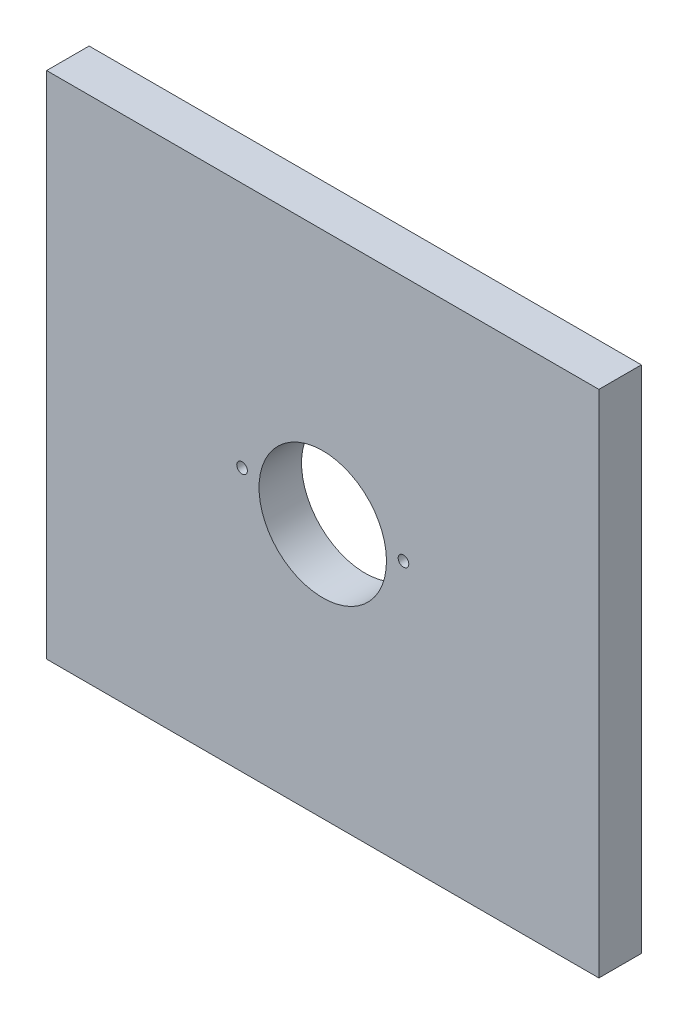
from build123d import *

# Parameters (mm, degrees)
ESQUISSE1_W             = 130
ESQUISSE1_H             = 120
ESQUISSE1_R             = 15
BASE_EXTRUSION_DEPTH    = 10
ESQUISSE2_R             = 1.25
ENL_V_MAT_EXTRU_1_DEPTH = 140.738848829


with BuildPart() as part:
    # Esquisse1 → Base-Extrusion (new body)
    with BuildSketch(Plane.XY):
        with Locations((-5.900958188, -60)):
            Rectangle(ESQUISSE1_W, ESQUISSE1_H)
        with Locations((-5.900958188, -60)):
            Circle(ESQUISSE1_R, mode=Mode.SUBTRACT)
    extrude(amount=BASE_EXTRUSION_DEPTH)

    # Esquisse2 → Enl_v. mat.-Extru.1 (cut, through all)
    with BuildSketch(Plane.XY.offset(10)):
        with Locations((-24.900958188, -58)):
            Circle(ESQUISSE2_R)
        with Locations((13.099041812, -58)):
            Circle(ESQUISSE2_R)
    extrude(amount=-ENL_V_MAT_EXTRU_1_DEPTH, mode=Mode.SUBTRACT)


solid = part.part
